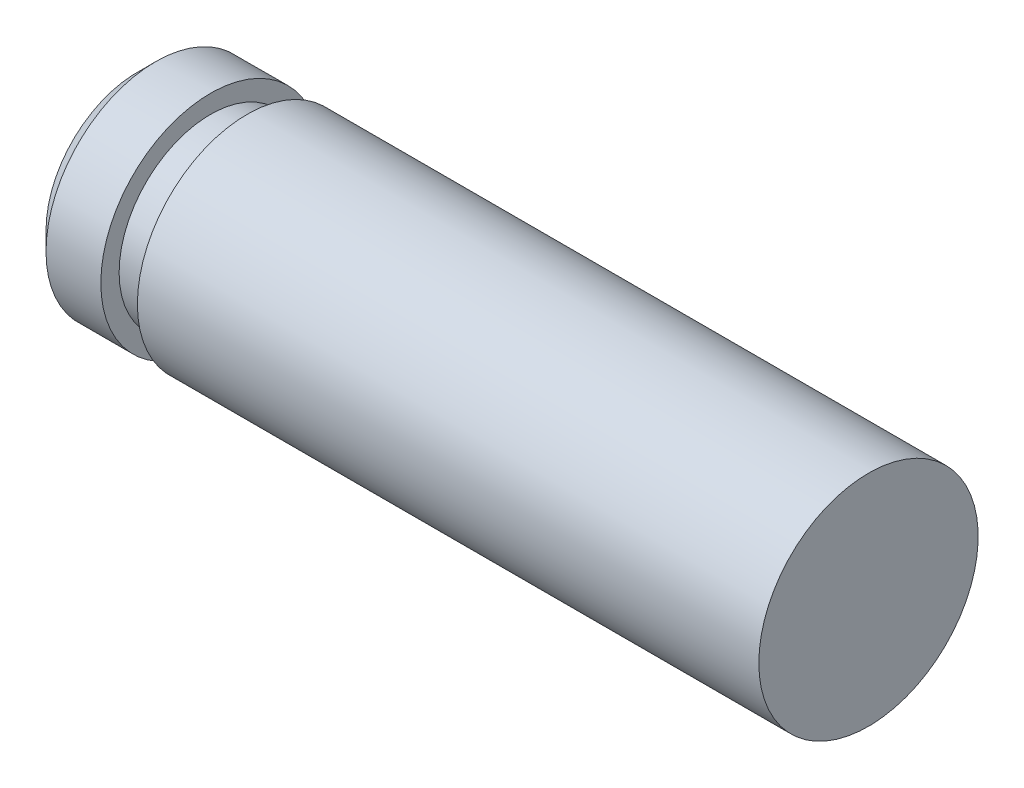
ISO-10303-21;
HEADER;
FILE_DESCRIPTION(('STEP AP214'),'2;1');
FILE_NAME('part.step','',(''),(''),'','','');
FILE_SCHEMA(('AUTOMOTIVE_DESIGN { 1 0 10303 214 1 1 1 1 }'));
ENDSEC;
DATA;
#1=APPLICATION_CONTEXT('core data for automotive mechanical design processes');
#2=APPLICATION_PROTOCOL_DEFINITION('international standard','automotive_design',2000,#1);
#3=PRODUCT_CONTEXT('',#1,'mechanical');
#4=PRODUCT('Part','Part','',(#3));
#5=PRODUCT_RELATED_PRODUCT_CATEGORY('part','',(#4));
#6=PRODUCT_DEFINITION_FORMATION('','',#4);
#7=PRODUCT_DEFINITION_CONTEXT('part definition',#1,'design');
#8=PRODUCT_DEFINITION('design','',#6,#7);
#9=PRODUCT_DEFINITION_SHAPE('','',#8);
#10=(LENGTH_UNIT() NAMED_UNIT(*) SI_UNIT(.MILLI.,.METRE.));
#11=(NAMED_UNIT(*) PLANE_ANGLE_UNIT() SI_UNIT($,.RADIAN.));
#12=(NAMED_UNIT(*) SI_UNIT($,.STERADIAN.) SOLID_ANGLE_UNIT());
#13=UNCERTAINTY_MEASURE_WITH_UNIT(LENGTH_MEASURE(1.E-05),#10,'distance_accuracy_value','');
#14=(GEOMETRIC_REPRESENTATION_CONTEXT(3) GLOBAL_UNCERTAINTY_ASSIGNED_CONTEXT((#13)) GLOBAL_UNIT_ASSIGNED_CONTEXT((#10,
#11,#12)) REPRESENTATION_CONTEXT('',''));
#15=CARTESIAN_POINT('',(0.,0.,0.));
#16=DIRECTION('',(0.,0.,1.));
#17=DIRECTION('',(1.,0.,0.));
#18=AXIS2_PLACEMENT_3D('',#15,#16,#17);
#19=CARTESIAN_POINT('',(0.,0.,0.));
#20=DIRECTION('',(1.,0.,0.));
#21=DIRECTION('',(0.,0.,-1.));
#22=AXIS2_PLACEMENT_3D('',#19,#20,#21);
#23=PLANE('',#22);
#24=CARTESIAN_POINT('',(0.,0.,0.));
#25=DIRECTION('',(1.,0.,0.));
#26=DIRECTION('',(0.,0.,-1.));
#27=AXIS2_PLACEMENT_3D('',#24,#25,#26);
#28=CIRCLE('',#27,2.5);
#29=CARTESIAN_POINT('',(0.,0.,-2.5));
#30=VERTEX_POINT('',#29);
#31=EDGE_CURVE('E37',#30,#30,#28,.F.);
#32=ORIENTED_EDGE('',*,*,#31,.T.);
#33=EDGE_LOOP('',(#32));
#34=FACE_BOUND('',#33,.T.);
#35=ADVANCED_FACE('F30',(#34),#23,.F.);
#36=CARTESIAN_POINT('',(-29.0102113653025,0.,0.));
#37=DIRECTION('',(-1.,0.,0.));
#38=DIRECTION('',(0.,0.,1.));
#39=AXIS2_PLACEMENT_3D('',#36,#37,#38);
#40=CYLINDRICAL_SURFACE('',#39,3.);
#41=CARTESIAN_POINT('',(0.5,0.,0.));
#42=DIRECTION('',(1.,0.,0.));
#43=DIRECTION('',(0.,0.,-1.));
#44=AXIS2_PLACEMENT_3D('',#41,#42,#43);
#45=CIRCLE('',#44,3.);
#46=CARTESIAN_POINT('',(0.5,0.,-3.));
#47=VERTEX_POINT('',#46);
#48=EDGE_CURVE('E10',#47,#47,#45,.T.);
#49=ORIENTED_EDGE('',*,*,#48,.T.);
#50=EDGE_LOOP('',(#49));
#51=FACE_BOUND('',#50,.T.);
#52=CARTESIAN_POINT('',(2.,0.,0.));
#53=DIRECTION('',(-1.,0.,0.));
#54=DIRECTION('',(0.,0.,1.));
#55=AXIS2_PLACEMENT_3D('',#52,#53,#54);
#56=CIRCLE('',#55,3.);
#57=CARTESIAN_POINT('',(2.,0.,3.));
#58=VERTEX_POINT('',#57);
#59=EDGE_CURVE('E41',#58,#58,#56,.T.);
#60=ORIENTED_EDGE('',*,*,#59,.T.);
#61=EDGE_LOOP('',(#60));
#62=FACE_BOUND('',#61,.T.);
#63=ADVANCED_FACE('F74',(#51,#62),#40,.T.);
#64=CARTESIAN_POINT('',(2.,3.,0.));
#65=DIRECTION('',(-1.,0.,0.));
#66=DIRECTION('',(0.,0.,1.));
#67=AXIS2_PLACEMENT_3D('',#64,#65,#66);
#68=PLANE('',#67);
#69=ORIENTED_EDGE('',*,*,#59,.F.);
#70=EDGE_LOOP('',(#69));
#71=FACE_BOUND('',#70,.T.);
#72=CARTESIAN_POINT('',(2.,0.,0.));
#73=DIRECTION('',(-1.,0.,0.));
#74=DIRECTION('',(0.,0.,1.));
#75=AXIS2_PLACEMENT_3D('',#72,#73,#74);
#76=CIRCLE('',#75,2.5);
#77=CARTESIAN_POINT('',(2.,0.,2.5));
#78=VERTEX_POINT('',#77);
#79=EDGE_CURVE('E45',#78,#78,#76,.T.);
#80=ORIENTED_EDGE('',*,*,#79,.T.);
#81=EDGE_LOOP('',(#80));
#82=FACE_BOUND('',#81,.T.);
#83=ADVANCED_FACE('F78',(#71,#82),#68,.F.);
#84=CARTESIAN_POINT('',(-29.0102113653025,0.,0.));
#85=DIRECTION('',(-1.,0.,0.));
#86=DIRECTION('',(0.,0.,1.));
#87=AXIS2_PLACEMENT_3D('',#84,#85,#86);
#88=CYLINDRICAL_SURFACE('',#87,2.5);
#89=ORIENTED_EDGE('',*,*,#79,.F.);
#90=EDGE_LOOP('',(#89));
#91=FACE_BOUND('',#90,.T.);
#92=CARTESIAN_POINT('',(3.,0.,0.));
#93=DIRECTION('',(-1.,0.,0.));
#94=DIRECTION('',(0.,0.,1.));
#95=AXIS2_PLACEMENT_3D('',#92,#93,#94);
#96=CIRCLE('',#95,2.5);
#97=CARTESIAN_POINT('',(3.,0.,2.5));
#98=VERTEX_POINT('',#97);
#99=EDGE_CURVE('E50',#98,#98,#96,.T.);
#100=ORIENTED_EDGE('',*,*,#99,.T.);
#101=EDGE_LOOP('',(#100));
#102=FACE_BOUND('',#101,.T.);
#103=ADVANCED_FACE('F83',(#91,#102),#88,.T.);
#104=CARTESIAN_POINT('',(3.,2.5,0.));
#105=DIRECTION('',(1.,0.,0.));
#106=DIRECTION('',(0.,0.,-1.));
#107=AXIS2_PLACEMENT_3D('',#104,#105,#106);
#108=PLANE('',#107);
#109=ORIENTED_EDGE('',*,*,#99,.F.);
#110=EDGE_LOOP('',(#109));
#111=FACE_BOUND('',#110,.T.);
#112=CARTESIAN_POINT('',(3.,0.,0.));
#113=DIRECTION('',(-1.,0.,0.));
#114=DIRECTION('',(0.,0.,1.));
#115=AXIS2_PLACEMENT_3D('',#112,#113,#114);
#116=CIRCLE('',#115,3.);
#117=CARTESIAN_POINT('',(3.,0.,3.));
#118=VERTEX_POINT('',#117);
#119=EDGE_CURVE('E53',#118,#118,#116,.T.);
#120=ORIENTED_EDGE('',*,*,#119,.T.);
#121=EDGE_LOOP('',(#120));
#122=FACE_BOUND('',#121,.T.);
#123=ADVANCED_FACE('F70',(#111,#122),#108,.F.);
#124=CARTESIAN_POINT('',(-29.0102113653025,0.,0.));
#125=DIRECTION('',(-1.,0.,0.));
#126=DIRECTION('',(0.,0.,1.));
#127=AXIS2_PLACEMENT_3D('',#124,#125,#126);
#128=CYLINDRICAL_SURFACE('',#127,3.);
#129=ORIENTED_EDGE('',*,*,#119,.F.);
#130=EDGE_LOOP('',(#129));
#131=FACE_BOUND('',#130,.T.);
#132=CARTESIAN_POINT('',(20.,0.,0.));
#133=DIRECTION('',(-1.,0.,0.));
#134=DIRECTION('',(0.,0.,1.));
#135=AXIS2_PLACEMENT_3D('',#132,#133,#134);
#136=CIRCLE('',#135,3.);
#137=CARTESIAN_POINT('',(20.,0.,3.));
#138=VERTEX_POINT('',#137);
#139=EDGE_CURVE('E56',#138,#138,#136,.T.);
#140=ORIENTED_EDGE('',*,*,#139,.T.);
#141=EDGE_LOOP('',(#140));
#142=FACE_BOUND('',#141,.T.);
#143=ADVANCED_FACE('F60',(#131,#142),#128,.T.);
#144=CARTESIAN_POINT('',(20.,3.,0.));
#145=DIRECTION('',(-1.,0.,0.));
#146=DIRECTION('',(0.,0.,1.));
#147=AXIS2_PLACEMENT_3D('',#144,#145,#146);
#148=PLANE('',#147);
#149=ORIENTED_EDGE('',*,*,#139,.F.);
#150=EDGE_LOOP('',(#149));
#151=FACE_BOUND('',#150,.T.);
#152=ADVANCED_FACE('F62',(#151),#148,.F.);
#153=CARTESIAN_POINT('',(0.,0.,0.));
#154=DIRECTION('',(1.,0.,0.));
#155=DIRECTION('',(0.,0.,-1.));
#156=AXIS2_PLACEMENT_3D('',#153,#154,#155);
#157=CONICAL_SURFACE('',#156,2.5,0.785398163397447);
#158=ORIENTED_EDGE('',*,*,#48,.F.);
#159=EDGE_LOOP('',(#158));
#160=FACE_BOUND('',#159,.T.);
#161=ORIENTED_EDGE('',*,*,#31,.F.);
#162=EDGE_LOOP('',(#161));
#163=FACE_BOUND('',#162,.T.);
#164=ADVANCED_FACE('F32',(#160,#163),#157,.T.);
#165=CLOSED_SHELL('',(#35,#63,#83,#103,#123,#143,#152,#164));
#166=MANIFOLD_SOLID_BREP('B2',#165);
#167=ADVANCED_BREP_SHAPE_REPRESENTATION('',(#18,#166),#14);
#168=SHAPE_DEFINITION_REPRESENTATION(#9,#167);
ENDSEC;
END-ISO-10303-21;
